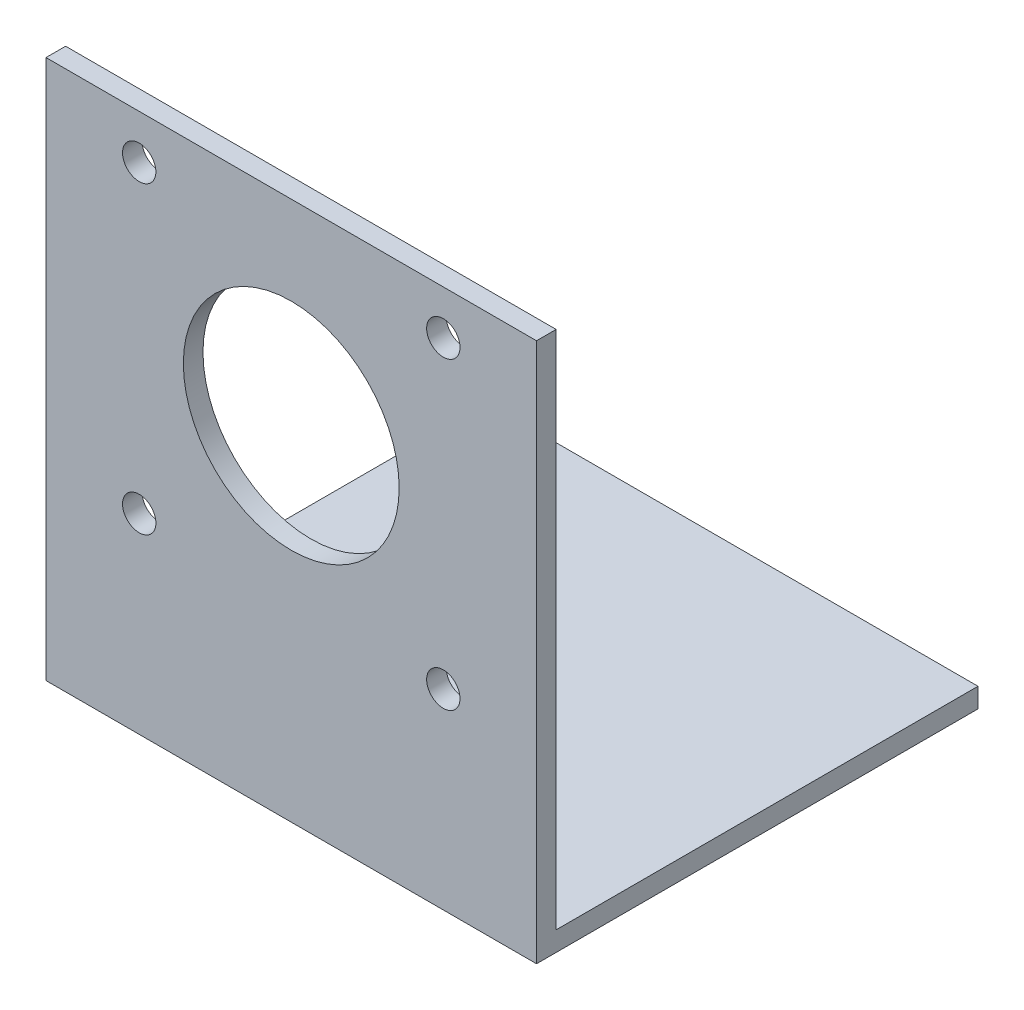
ISO-10303-21;
HEADER;
FILE_DESCRIPTION(('STEP AP214'),'2;1');
FILE_NAME('part.step','',(''),(''),'','','');
FILE_SCHEMA(('AUTOMOTIVE_DESIGN { 1 0 10303 214 1 1 1 1 }'));
ENDSEC;
DATA;
#1=APPLICATION_CONTEXT('core data for automotive mechanical design processes');
#2=APPLICATION_PROTOCOL_DEFINITION('international standard','automotive_design',2000,#1);
#3=PRODUCT_CONTEXT('',#1,'mechanical');
#4=PRODUCT('Part','Part','',(#3));
#5=PRODUCT_RELATED_PRODUCT_CATEGORY('part','',(#4));
#6=PRODUCT_DEFINITION_FORMATION('','',#4);
#7=PRODUCT_DEFINITION_CONTEXT('part definition',#1,'design');
#8=PRODUCT_DEFINITION('design','',#6,#7);
#9=PRODUCT_DEFINITION_SHAPE('','',#8);
#10=(LENGTH_UNIT() NAMED_UNIT(*) SI_UNIT(.MILLI.,.METRE.));
#11=(NAMED_UNIT(*) PLANE_ANGLE_UNIT() SI_UNIT($,.RADIAN.));
#12=(NAMED_UNIT(*) SI_UNIT($,.STERADIAN.) SOLID_ANGLE_UNIT());
#13=UNCERTAINTY_MEASURE_WITH_UNIT(LENGTH_MEASURE(1.E-05),#10,'distance_accuracy_value','');
#14=(GEOMETRIC_REPRESENTATION_CONTEXT(3) GLOBAL_UNCERTAINTY_ASSIGNED_CONTEXT((#13)) GLOBAL_UNIT_ASSIGNED_CONTEXT((#10,
#11,#12)) REPRESENTATION_CONTEXT('',''));
#15=CARTESIAN_POINT('',(0.,0.,0.));
#16=DIRECTION('',(0.,0.,1.));
#17=DIRECTION('',(1.,0.,0.));
#18=AXIS2_PLACEMENT_3D('',#15,#16,#17);
#19=CARTESIAN_POINT('',(0.,0.,0.));
#20=DIRECTION('',(0.,0.,-1.));
#21=DIRECTION('',(-1.,0.,0.));
#22=AXIS2_PLACEMENT_3D('',#19,#20,#21);
#23=PLANE('',#22);
#24=CARTESIAN_POINT('',(0.,35.,0.));
#25=DIRECTION('',(0.,0.,-1.));
#26=DIRECTION('',(-1.,0.,0.));
#27=AXIS2_PLACEMENT_3D('',#24,#25,#26);
#28=CIRCLE('',#27,11.);
#29=CARTESIAN_POINT('',(-11.,35.,0.));
#30=VERTEX_POINT('',#29);
#31=EDGE_CURVE('E183',#30,#30,#28,.F.);
#32=ORIENTED_EDGE('',*,*,#31,.F.);
#33=EDGE_LOOP('',(#32));
#34=FACE_BOUND('',#33,.T.);
#35=DIRECTION('',(0.,1.,0.));
#36=VECTOR('',#35,1.);
#37=CARTESIAN_POINT('',(25.,0.,0.));
#38=LINE('',#37,#36);
#39=CARTESIAN_POINT('',(25.,0.,0.));
#40=VERTEX_POINT('',#39);
#41=CARTESIAN_POINT('',(25.,55.,0.));
#42=VERTEX_POINT('',#41);
#43=EDGE_CURVE('E99',#40,#42,#38,.T.);
#44=ORIENTED_EDGE('',*,*,#43,.T.);
#45=DIRECTION('',(-1.,0.,0.));
#46=VECTOR('',#45,1.);
#47=CARTESIAN_POINT('',(-25.,55.,0.));
#48=LINE('',#47,#46);
#49=CARTESIAN_POINT('',(-25.,55.,0.));
#50=VERTEX_POINT('',#49);
#51=EDGE_CURVE('E84',#42,#50,#48,.T.);
#52=ORIENTED_EDGE('',*,*,#51,.T.);
#53=DIRECTION('',(0.,-1.,0.));
#54=VECTOR('',#53,1.);
#55=CARTESIAN_POINT('',(-25.,0.,0.));
#56=LINE('',#55,#54);
#57=CARTESIAN_POINT('',(-25.,0.,0.));
#58=VERTEX_POINT('',#57);
#59=EDGE_CURVE('E86',#50,#58,#56,.T.);
#60=ORIENTED_EDGE('',*,*,#59,.T.);
#61=DIRECTION('',(1.,0.,0.));
#62=VECTOR('',#61,1.);
#63=CARTESIAN_POINT('',(-25.,0.,0.));
#64=LINE('',#63,#62);
#65=EDGE_CURVE('E92',#58,#40,#64,.T.);
#66=ORIENTED_EDGE('',*,*,#65,.T.);
#67=EDGE_LOOP('',(#44,#52,#60,#66));
#68=FACE_BOUND('',#67,.T.);
#69=CARTESIAN_POINT('',(-15.5,19.5,1.2E-05));
#70=DIRECTION('',(0.,0.,1.));
#71=DIRECTION('',(1.,0.,0.));
#72=AXIS2_PLACEMENT_3D('',#69,#70,#71);
#73=CIRCLE('',#72,1.7);
#74=CARTESIAN_POINT('',(-13.8,19.5,1.2E-05));
#75=VERTEX_POINT('',#74);
#76=EDGE_CURVE('E120',#75,#75,#73,.T.);
#77=ORIENTED_EDGE('',*,*,#76,.F.);
#78=EDGE_LOOP('',(#77));
#79=FACE_BOUND('',#78,.T.);
#80=CARTESIAN_POINT('',(15.5,50.5,1.2E-05));
#81=DIRECTION('',(0.,0.,1.));
#82=DIRECTION('',(1.,0.,0.));
#83=AXIS2_PLACEMENT_3D('',#80,#81,#82);
#84=CIRCLE('',#83,1.7);
#85=CARTESIAN_POINT('',(17.2,50.5,1.2E-05));
#86=VERTEX_POINT('',#85);
#87=EDGE_CURVE('E182',#86,#86,#84,.T.);
#88=ORIENTED_EDGE('',*,*,#87,.F.);
#89=EDGE_LOOP('',(#88));
#90=FACE_BOUND('',#89,.T.);
#91=CARTESIAN_POINT('',(15.5,19.5,1.2E-05));
#92=DIRECTION('',(0.,0.,1.));
#93=DIRECTION('',(1.,0.,0.));
#94=AXIS2_PLACEMENT_3D('',#91,#92,#93);
#95=CIRCLE('',#94,1.7);
#96=CARTESIAN_POINT('',(17.2,19.5,1.2E-05));
#97=VERTEX_POINT('',#96);
#98=EDGE_CURVE('E170',#97,#97,#95,.T.);
#99=ORIENTED_EDGE('',*,*,#98,.F.);
#100=EDGE_LOOP('',(#99));
#101=FACE_BOUND('',#100,.T.);
#102=CARTESIAN_POINT('',(-15.5,50.5,1.2E-05));
#103=DIRECTION('',(0.,0.,1.));
#104=DIRECTION('',(1.,0.,0.));
#105=AXIS2_PLACEMENT_3D('',#102,#103,#104);
#106=CIRCLE('',#105,1.7);
#107=CARTESIAN_POINT('',(-13.8,50.5,1.2E-05));
#108=VERTEX_POINT('',#107);
#109=EDGE_CURVE('E180',#108,#108,#106,.T.);
#110=ORIENTED_EDGE('',*,*,#109,.F.);
#111=EDGE_LOOP('',(#110));
#112=FACE_BOUND('',#111,.T.);
#113=ADVANCED_FACE('F39',(#34,#68,#79,#90,#101,#112),#23,.F.);
#114=CARTESIAN_POINT('',(-25.,0.,-2.));
#115=DIRECTION('',(-1.,0.,0.));
#116=DIRECTION('',(0.,0.,1.));
#117=AXIS2_PLACEMENT_3D('',#114,#115,#116);
#118=PLANE('',#117);
#119=DIRECTION('',(0.,0.,1.));
#120=VECTOR('',#119,1.);
#121=CARTESIAN_POINT('',(-25.,0.,-2.));
#122=LINE('',#121,#120);
#123=CARTESIAN_POINT('',(-25.,0.,-45.));
#124=VERTEX_POINT('',#123);
#125=EDGE_CURVE('E93',#124,#58,#122,.T.);
#126=ORIENTED_EDGE('',*,*,#125,.T.);
#127=ORIENTED_EDGE('',*,*,#59,.F.);
#128=DIRECTION('',(0.,0.,1.));
#129=VECTOR('',#128,1.);
#130=CARTESIAN_POINT('',(-25.,55.,-2.));
#131=LINE('',#130,#129);
#132=CARTESIAN_POINT('',(-25.,55.,-2.));
#133=VERTEX_POINT('',#132);
#134=EDGE_CURVE('E48',#133,#50,#131,.T.);
#135=ORIENTED_EDGE('',*,*,#134,.F.);
#136=DIRECTION('',(0.,-1.,0.));
#137=VECTOR('',#136,1.);
#138=CARTESIAN_POINT('',(-25.,0.,-2.));
#139=LINE('',#138,#137);
#140=CARTESIAN_POINT('',(-25.,2.,-2.));
#141=VERTEX_POINT('',#140);
#142=EDGE_CURVE('E105',#133,#141,#139,.T.);
#143=ORIENTED_EDGE('',*,*,#142,.T.);
#144=DIRECTION('',(0.,0.,1.));
#145=VECTOR('',#144,1.);
#146=CARTESIAN_POINT('',(-25.,2.,-45.));
#147=LINE('',#146,#145);
#148=CARTESIAN_POINT('',(-25.,2.,-45.));
#149=VERTEX_POINT('',#148);
#150=EDGE_CURVE('E96',#149,#141,#147,.T.);
#151=ORIENTED_EDGE('',*,*,#150,.F.);
#152=DIRECTION('',(0.,-1.,0.));
#153=VECTOR('',#152,1.);
#154=CARTESIAN_POINT('',(-25.,0.,-45.));
#155=LINE('',#154,#153);
#156=EDGE_CURVE('E127',#149,#124,#155,.T.);
#157=ORIENTED_EDGE('',*,*,#156,.T.);
#158=EDGE_LOOP('',(#126,#127,#135,#143,#151,#157));
#159=FACE_BOUND('',#158,.T.);
#160=ADVANCED_FACE('F41',(#159),#118,.T.);
#161=CARTESIAN_POINT('',(-25.,55.,-2.));
#162=DIRECTION('',(0.,1.,0.));
#163=DIRECTION('',(0.,0.,1.));
#164=AXIS2_PLACEMENT_3D('',#161,#162,#163);
#165=PLANE('',#164);
#166=ORIENTED_EDGE('',*,*,#51,.F.);
#167=DIRECTION('',(0.,0.,1.));
#168=VECTOR('',#167,1.);
#169=CARTESIAN_POINT('',(25.,55.,-2.));
#170=LINE('',#169,#168);
#171=CARTESIAN_POINT('',(25.,55.,-2.));
#172=VERTEX_POINT('',#171);
#173=EDGE_CURVE('E83',#172,#42,#170,.T.);
#174=ORIENTED_EDGE('',*,*,#173,.F.);
#175=DIRECTION('',(-1.,0.,0.));
#176=VECTOR('',#175,1.);
#177=CARTESIAN_POINT('',(-25.,55.,-2.));
#178=LINE('',#177,#176);
#179=EDGE_CURVE('E81',#172,#133,#178,.T.);
#180=ORIENTED_EDGE('',*,*,#179,.T.);
#181=ORIENTED_EDGE('',*,*,#134,.T.);
#182=EDGE_LOOP('',(#166,#174,#180,#181));
#183=FACE_BOUND('',#182,.T.);
#184=ADVANCED_FACE('F78',(#183),#165,.T.);
#185=CARTESIAN_POINT('',(25.,0.,-2.));
#186=DIRECTION('',(1.,0.,0.));
#187=DIRECTION('',(0.,0.,-1.));
#188=AXIS2_PLACEMENT_3D('',#185,#186,#187);
#189=PLANE('',#188);
#190=ORIENTED_EDGE('',*,*,#173,.T.);
#191=ORIENTED_EDGE('',*,*,#43,.F.);
#192=DIRECTION('',(0.,0.,1.));
#193=VECTOR('',#192,1.);
#194=CARTESIAN_POINT('',(25.,0.,-2.));
#195=LINE('',#194,#193);
#196=CARTESIAN_POINT('',(25.,0.,-45.));
#197=VERTEX_POINT('',#196);
#198=EDGE_CURVE('E109',#197,#40,#195,.T.);
#199=ORIENTED_EDGE('',*,*,#198,.F.);
#200=DIRECTION('',(0.,1.,0.));
#201=VECTOR('',#200,1.);
#202=CARTESIAN_POINT('',(25.,0.,-45.));
#203=LINE('',#202,#201);
#204=CARTESIAN_POINT('',(25.,2.,-45.));
#205=VERTEX_POINT('',#204);
#206=EDGE_CURVE('E253',#197,#205,#203,.T.);
#207=ORIENTED_EDGE('',*,*,#206,.T.);
#208=DIRECTION('',(0.,0.,1.));
#209=VECTOR('',#208,1.);
#210=CARTESIAN_POINT('',(25.,2.,-45.));
#211=LINE('',#210,#209);
#212=CARTESIAN_POINT('',(25.,2.,-2.00000000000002));
#213=VERTEX_POINT('',#212);
#214=EDGE_CURVE('E260',#205,#213,#211,.T.);
#215=ORIENTED_EDGE('',*,*,#214,.T.);
#216=DIRECTION('',(0.,1.,0.));
#217=VECTOR('',#216,1.);
#218=CARTESIAN_POINT('',(25.,0.,-2.));
#219=LINE('',#218,#217);
#220=EDGE_CURVE('E102',#213,#172,#219,.T.);
#221=ORIENTED_EDGE('',*,*,#220,.T.);
#222=EDGE_LOOP('',(#190,#191,#199,#207,#215,#221));
#223=FACE_BOUND('',#222,.T.);
#224=ADVANCED_FACE('F271',(#223),#189,.T.);
#225=CARTESIAN_POINT('',(-25.,0.,-2.));
#226=DIRECTION('',(0.,-1.,0.));
#227=DIRECTION('',(0.,0.,-1.));
#228=AXIS2_PLACEMENT_3D('',#225,#226,#227);
#229=PLANE('',#228);
#230=ORIENTED_EDGE('',*,*,#65,.F.);
#231=ORIENTED_EDGE('',*,*,#125,.F.);
#232=DIRECTION('',(1.,0.,0.));
#233=VECTOR('',#232,1.);
#234=CARTESIAN_POINT('',(-25.,0.,-45.));
#235=LINE('',#234,#233);
#236=EDGE_CURVE('E250',#124,#197,#235,.T.);
#237=ORIENTED_EDGE('',*,*,#236,.T.);
#238=ORIENTED_EDGE('',*,*,#198,.T.);
#239=EDGE_LOOP('',(#230,#231,#237,#238));
#240=FACE_BOUND('',#239,.T.);
#241=ADVANCED_FACE('F262',(#240),#229,.T.);
#242=CARTESIAN_POINT('',(0.,0.,-2.));
#243=DIRECTION('',(0.,0.,-1.));
#244=DIRECTION('',(-1.,0.,0.));
#245=AXIS2_PLACEMENT_3D('',#242,#243,#244);
#246=PLANE('',#245);
#247=CARTESIAN_POINT('',(0.,35.,-2.));
#248=DIRECTION('',(0.,0.,-1.));
#249=DIRECTION('',(-1.,0.,0.));
#250=AXIS2_PLACEMENT_3D('',#247,#248,#249);
#251=CIRCLE('',#250,11.);
#252=CARTESIAN_POINT('',(-11.,35.,-2.));
#253=VERTEX_POINT('',#252);
#254=EDGE_CURVE('E43',#253,#253,#251,.F.);
#255=ORIENTED_EDGE('',*,*,#254,.T.);
#256=EDGE_LOOP('',(#255));
#257=FACE_BOUND('',#256,.T.);
#258=CARTESIAN_POINT('',(-15.5,50.5,-2.));
#259=DIRECTION('',(0.,0.,-1.));
#260=DIRECTION('',(-1.,0.,0.));
#261=AXIS2_PLACEMENT_3D('',#258,#259,#260);
#262=CIRCLE('',#261,1.7);
#263=CARTESIAN_POINT('',(-17.2,50.5,-2.));
#264=VERTEX_POINT('',#263);
#265=EDGE_CURVE('E125',#264,#264,#262,.F.);
#266=ORIENTED_EDGE('',*,*,#265,.T.);
#267=EDGE_LOOP('',(#266));
#268=FACE_BOUND('',#267,.T.);
#269=CARTESIAN_POINT('',(15.5,19.5,-2.));
#270=DIRECTION('',(0.,0.,-1.));
#271=DIRECTION('',(-1.,0.,0.));
#272=AXIS2_PLACEMENT_3D('',#269,#270,#271);
#273=CIRCLE('',#272,1.7);
#274=CARTESIAN_POINT('',(13.8,19.5,-2.));
#275=VERTEX_POINT('',#274);
#276=EDGE_CURVE('E119',#275,#275,#273,.F.);
#277=ORIENTED_EDGE('',*,*,#276,.T.);
#278=EDGE_LOOP('',(#277));
#279=FACE_BOUND('',#278,.T.);
#280=CARTESIAN_POINT('',(15.5,50.5,-2.));
#281=DIRECTION('',(0.,0.,-1.));
#282=DIRECTION('',(-1.,0.,0.));
#283=AXIS2_PLACEMENT_3D('',#280,#281,#282);
#284=CIRCLE('',#283,1.7);
#285=CARTESIAN_POINT('',(13.8,50.5,-2.));
#286=VERTEX_POINT('',#285);
#287=EDGE_CURVE('E116',#286,#286,#284,.F.);
#288=ORIENTED_EDGE('',*,*,#287,.T.);
#289=EDGE_LOOP('',(#288));
#290=FACE_BOUND('',#289,.T.);
#291=CARTESIAN_POINT('',(-15.5,19.5,-2.));
#292=DIRECTION('',(0.,0.,-1.));
#293=DIRECTION('',(-1.,0.,0.));
#294=AXIS2_PLACEMENT_3D('',#291,#292,#293);
#295=CIRCLE('',#294,1.7);
#296=CARTESIAN_POINT('',(-17.2,19.5,-2.));
#297=VERTEX_POINT('',#296);
#298=EDGE_CURVE('E114',#297,#297,#295,.F.);
#299=ORIENTED_EDGE('',*,*,#298,.T.);
#300=EDGE_LOOP('',(#299));
#301=FACE_BOUND('',#300,.T.);
#302=DIRECTION('',(1.,0.,0.));
#303=VECTOR('',#302,1.);
#304=CARTESIAN_POINT('',(0.,2.,-2.));
#305=LINE('',#304,#303);
#306=EDGE_CURVE('E11',#141,#213,#305,.T.);
#307=ORIENTED_EDGE('',*,*,#306,.F.);
#308=ORIENTED_EDGE('',*,*,#142,.F.);
#309=ORIENTED_EDGE('',*,*,#179,.F.);
#310=ORIENTED_EDGE('',*,*,#220,.F.);
#311=EDGE_LOOP('',(#307,#308,#309,#310));
#312=FACE_BOUND('',#311,.T.);
#313=ADVANCED_FACE('F148',(#257,#268,#279,#290,#301,#312),#246,.T.);
#314=CARTESIAN_POINT('',(-25.,2.,-45.));
#315=DIRECTION('',(0.,1.,0.));
#316=DIRECTION('',(0.,0.,1.));
#317=AXIS2_PLACEMENT_3D('',#314,#315,#316);
#318=PLANE('',#317);
#319=ORIENTED_EDGE('',*,*,#150,.T.);
#320=ORIENTED_EDGE('',*,*,#306,.T.);
#321=ORIENTED_EDGE('',*,*,#214,.F.);
#322=DIRECTION('',(-1.,0.,0.));
#323=VECTOR('',#322,1.);
#324=CARTESIAN_POINT('',(-25.,2.,-45.));
#325=LINE('',#324,#323);
#326=EDGE_CURVE('E255',#205,#149,#325,.T.);
#327=ORIENTED_EDGE('',*,*,#326,.T.);
#328=EDGE_LOOP('',(#319,#320,#321,#327));
#329=FACE_BOUND('',#328,.T.);
#330=ADVANCED_FACE('F277',(#329),#318,.T.);
#331=CARTESIAN_POINT('',(0.,0.,-45.));
#332=DIRECTION('',(0.,0.,-1.));
#333=DIRECTION('',(-1.,0.,0.));
#334=AXIS2_PLACEMENT_3D('',#331,#332,#333);
#335=PLANE('',#334);
#336=ORIENTED_EDGE('',*,*,#156,.F.);
#337=ORIENTED_EDGE('',*,*,#326,.F.);
#338=ORIENTED_EDGE('',*,*,#206,.F.);
#339=ORIENTED_EDGE('',*,*,#236,.F.);
#340=EDGE_LOOP('',(#336,#337,#338,#339));
#341=FACE_BOUND('',#340,.T.);
#342=ADVANCED_FACE('F285',(#341),#335,.T.);
#343=CARTESIAN_POINT('',(-15.5,19.5,1.2E-05));
#344=DIRECTION('',(0.,0.,-1.));
#345=DIRECTION('',(-1.,0.,0.));
#346=AXIS2_PLACEMENT_3D('',#343,#344,#345);
#347=CYLINDRICAL_SURFACE('',#346,1.7);
#348=ORIENTED_EDGE('',*,*,#298,.F.);
#349=EDGE_LOOP('',(#348));
#350=FACE_BOUND('',#349,.T.);
#351=ORIENTED_EDGE('',*,*,#76,.T.);
#352=EDGE_LOOP('',(#351));
#353=FACE_BOUND('',#352,.T.);
#354=ADVANCED_FACE('F217',(#350,#353),#347,.F.);
#355=CARTESIAN_POINT('',(15.5,50.5,1.2E-05));
#356=DIRECTION('',(0.,0.,-1.));
#357=DIRECTION('',(-1.,0.,0.));
#358=AXIS2_PLACEMENT_3D('',#355,#356,#357);
#359=CYLINDRICAL_SURFACE('',#358,1.7);
#360=ORIENTED_EDGE('',*,*,#287,.F.);
#361=EDGE_LOOP('',(#360));
#362=FACE_BOUND('',#361,.T.);
#363=ORIENTED_EDGE('',*,*,#87,.T.);
#364=EDGE_LOOP('',(#363));
#365=FACE_BOUND('',#364,.T.);
#366=ADVANCED_FACE('F211',(#362,#365),#359,.F.);
#367=CARTESIAN_POINT('',(15.5,19.5,1.2E-05));
#368=DIRECTION('',(0.,0.,-1.));
#369=DIRECTION('',(-1.,0.,0.));
#370=AXIS2_PLACEMENT_3D('',#367,#368,#369);
#371=CYLINDRICAL_SURFACE('',#370,1.7);
#372=ORIENTED_EDGE('',*,*,#276,.F.);
#373=EDGE_LOOP('',(#372));
#374=FACE_BOUND('',#373,.T.);
#375=ORIENTED_EDGE('',*,*,#98,.T.);
#376=EDGE_LOOP('',(#375));
#377=FACE_BOUND('',#376,.T.);
#378=ADVANCED_FACE('F207',(#374,#377),#371,.F.);
#379=CARTESIAN_POINT('',(-15.5,50.5,1.2E-05));
#380=DIRECTION('',(0.,0.,-1.));
#381=DIRECTION('',(-1.,0.,0.));
#382=AXIS2_PLACEMENT_3D('',#379,#380,#381);
#383=CYLINDRICAL_SURFACE('',#382,1.7);
#384=ORIENTED_EDGE('',*,*,#265,.F.);
#385=EDGE_LOOP('',(#384));
#386=FACE_BOUND('',#385,.T.);
#387=ORIENTED_EDGE('',*,*,#109,.T.);
#388=EDGE_LOOP('',(#387));
#389=FACE_BOUND('',#388,.T.);
#390=ADVANCED_FACE('F196',(#386,#389),#383,.F.);
#391=CARTESIAN_POINT('',(0.,35.,0.0826770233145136));
#392=DIRECTION('',(0.,0.,-1.));
#393=DIRECTION('',(-1.,0.,0.));
#394=AXIS2_PLACEMENT_3D('',#391,#392,#393);
#395=CYLINDRICAL_SURFACE('',#394,11.);
#396=ORIENTED_EDGE('',*,*,#254,.F.);
#397=EDGE_LOOP('',(#396));
#398=FACE_BOUND('',#397,.T.);
#399=ORIENTED_EDGE('',*,*,#31,.T.);
#400=EDGE_LOOP('',(#399));
#401=FACE_BOUND('',#400,.T.);
#402=ADVANCED_FACE('F208',(#398,#401),#395,.F.);
#403=CLOSED_SHELL('',(#113,#160,#184,#224,#241,#313,#330,#342,#354,#366,#378,#390,#402));
#404=MANIFOLD_SOLID_BREP('B2',#403);
#405=ADVANCED_BREP_SHAPE_REPRESENTATION('',(#18,#404),#14);
#406=SHAPE_DEFINITION_REPRESENTATION(#9,#405);
ENDSEC;
END-ISO-10303-21;
